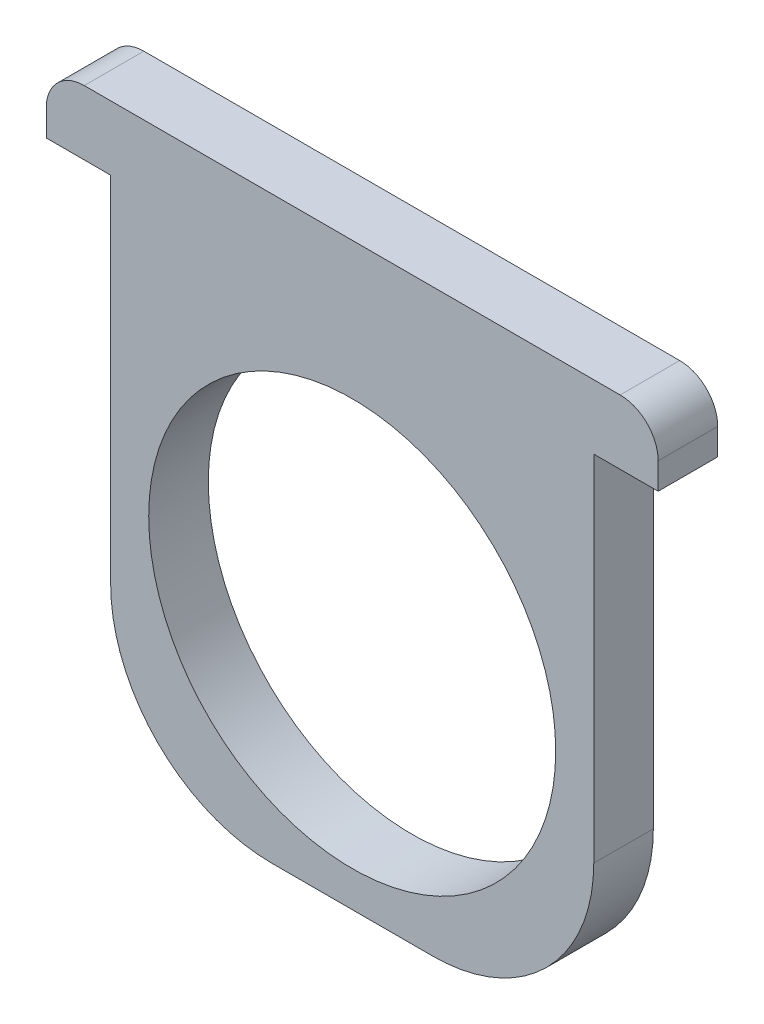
ISO-10303-21;
HEADER;
FILE_DESCRIPTION(('STEP AP214'),'2;1');
FILE_NAME('part.step','',(''),(''),'','','');
FILE_SCHEMA(('AUTOMOTIVE_DESIGN { 1 0 10303 214 1 1 1 1 }'));
ENDSEC;
DATA;
#1=APPLICATION_CONTEXT('core data for automotive mechanical design processes');
#2=APPLICATION_PROTOCOL_DEFINITION('international standard','automotive_design',2000,#1);
#3=PRODUCT_CONTEXT('',#1,'mechanical');
#4=PRODUCT('Part','Part','',(#3));
#5=PRODUCT_RELATED_PRODUCT_CATEGORY('part','',(#4));
#6=PRODUCT_DEFINITION_FORMATION('','',#4);
#7=PRODUCT_DEFINITION_CONTEXT('part definition',#1,'design');
#8=PRODUCT_DEFINITION('design','',#6,#7);
#9=PRODUCT_DEFINITION_SHAPE('','',#8);
#10=(LENGTH_UNIT() NAMED_UNIT(*) SI_UNIT(.MILLI.,.METRE.));
#11=(NAMED_UNIT(*) PLANE_ANGLE_UNIT() SI_UNIT($,.RADIAN.));
#12=(NAMED_UNIT(*) SI_UNIT($,.STERADIAN.) SOLID_ANGLE_UNIT());
#13=UNCERTAINTY_MEASURE_WITH_UNIT(LENGTH_MEASURE(1.E-05),#10,'distance_accuracy_value','');
#14=(GEOMETRIC_REPRESENTATION_CONTEXT(3) GLOBAL_UNCERTAINTY_ASSIGNED_CONTEXT((#13)) GLOBAL_UNIT_ASSIGNED_CONTEXT((#10,
#11,#12)) REPRESENTATION_CONTEXT('',''));
#15=CARTESIAN_POINT('',(0.,0.,0.));
#16=DIRECTION('',(0.,0.,1.));
#17=DIRECTION('',(1.,0.,0.));
#18=AXIS2_PLACEMENT_3D('',#15,#16,#17);
#19=CARTESIAN_POINT('',(-24.13,25.4,2.3495));
#20=DIRECTION('',(1.,0.,0.));
#21=DIRECTION('',(0.,0.,-1.));
#22=AXIS2_PLACEMENT_3D('',#19,#20,#21);
#23=PLANE('',#22);
#24=DIRECTION('',(0.,-1.,0.));
#25=VECTOR('',#24,1.);
#26=CARTESIAN_POINT('',(-24.13,25.4,2.3495));
#27=LINE('',#26,#25);
#28=CARTESIAN_POINT('',(-24.13,22.4,2.3495));
#29=VERTEX_POINT('',#28);
#30=CARTESIAN_POINT('',(-24.13,20.32,2.3495));
#31=VERTEX_POINT('',#30);
#32=EDGE_CURVE('E122',#29,#31,#27,.T.);
#33=ORIENTED_EDGE('',*,*,#32,.F.);
#34=DIRECTION('',(0.,0.,-1.));
#35=VECTOR('',#34,1.);
#36=CARTESIAN_POINT('',(-24.13,22.4,2.3495));
#37=LINE('',#36,#35);
#38=CARTESIAN_POINT('',(-24.13,22.4,-2.3495));
#39=VERTEX_POINT('',#38);
#40=EDGE_CURVE('E11',#29,#39,#37,.T.);
#41=ORIENTED_EDGE('',*,*,#40,.T.);
#42=DIRECTION('',(0.,-1.,0.));
#43=VECTOR('',#42,1.);
#44=CARTESIAN_POINT('',(-24.13,25.4,-2.3495));
#45=LINE('',#44,#43);
#46=CARTESIAN_POINT('',(-24.13,20.32,-2.3495));
#47=VERTEX_POINT('',#46);
#48=EDGE_CURVE('E143',#39,#47,#45,.T.);
#49=ORIENTED_EDGE('',*,*,#48,.T.);
#50=DIRECTION('',(0.,0.,-1.));
#51=VECTOR('',#50,1.);
#52=CARTESIAN_POINT('',(-24.13,20.32,2.3495));
#53=LINE('',#52,#51);
#54=EDGE_CURVE('E136',#31,#47,#53,.T.);
#55=ORIENTED_EDGE('',*,*,#54,.F.);
#56=EDGE_LOOP('',(#33,#41,#49,#55));
#57=FACE_BOUND('',#56,.T.);
#58=ADVANCED_FACE('F33',(#57),#23,.F.);
#59=CARTESIAN_POINT('',(-24.13,20.32,2.3495));
#60=DIRECTION('',(0.,1.,0.));
#61=DIRECTION('',(0.,0.,1.));
#62=AXIS2_PLACEMENT_3D('',#59,#60,#61);
#63=PLANE('',#62);
#64=DIRECTION('',(1.,0.,0.));
#65=VECTOR('',#64,1.);
#66=CARTESIAN_POINT('',(-24.13,20.32,-2.3495));
#67=LINE('',#66,#65);
#68=CARTESIAN_POINT('',(-19.05,20.32,-2.3495));
#69=VERTEX_POINT('',#68);
#70=EDGE_CURVE('E224',#47,#69,#67,.T.);
#71=ORIENTED_EDGE('',*,*,#70,.T.);
#72=DIRECTION('',(0.,0.,-1.));
#73=VECTOR('',#72,1.);
#74=CARTESIAN_POINT('',(-19.05,20.32,2.3495));
#75=LINE('',#74,#73);
#76=CARTESIAN_POINT('',(-19.05,20.32,2.3495));
#77=VERTEX_POINT('',#76);
#78=EDGE_CURVE('E138',#77,#69,#75,.T.);
#79=ORIENTED_EDGE('',*,*,#78,.F.);
#80=DIRECTION('',(1.,0.,0.));
#81=VECTOR('',#80,1.);
#82=CARTESIAN_POINT('',(-24.13,20.32,2.3495));
#83=LINE('',#82,#81);
#84=EDGE_CURVE('E126',#31,#77,#83,.T.);
#85=ORIENTED_EDGE('',*,*,#84,.F.);
#86=ORIENTED_EDGE('',*,*,#54,.T.);
#87=EDGE_LOOP('',(#71,#79,#85,#86));
#88=FACE_BOUND('',#87,.T.);
#89=ADVANCED_FACE('F135',(#88),#63,.F.);
#90=CARTESIAN_POINT('',(-19.05,20.32,2.3495));
#91=DIRECTION('',(1.,0.,0.));
#92=DIRECTION('',(0.,0.,-1.));
#93=AXIS2_PLACEMENT_3D('',#90,#91,#92);
#94=PLANE('',#93);
#95=DIRECTION('',(0.,-1.,0.));
#96=VECTOR('',#95,1.);
#97=CARTESIAN_POINT('',(-19.05,20.32,-2.3495));
#98=LINE('',#97,#96);
#99=CARTESIAN_POINT('',(-19.05,-7.62,-2.3495));
#100=VERTEX_POINT('',#99);
#101=EDGE_CURVE('E219',#69,#100,#98,.T.);
#102=ORIENTED_EDGE('',*,*,#101,.T.);
#103=DIRECTION('',(0.,0.,-1.));
#104=VECTOR('',#103,1.);
#105=CARTESIAN_POINT('',(-19.05,-7.62,2.3495));
#106=LINE('',#105,#104);
#107=CARTESIAN_POINT('',(-19.05,-7.62,2.3495));
#108=VERTEX_POINT('',#107);
#109=EDGE_CURVE('E159',#100,#108,#106,.F.);
#110=ORIENTED_EDGE('',*,*,#109,.T.);
#111=DIRECTION('',(0.,-1.,0.));
#112=VECTOR('',#111,1.);
#113=CARTESIAN_POINT('',(-19.05,20.32,2.3495));
#114=LINE('',#113,#112);
#115=EDGE_CURVE('E140',#77,#108,#114,.T.);
#116=ORIENTED_EDGE('',*,*,#115,.F.);
#117=ORIENTED_EDGE('',*,*,#78,.T.);
#118=EDGE_LOOP('',(#102,#110,#116,#117));
#119=FACE_BOUND('',#118,.T.);
#120=ADVANCED_FACE('F262',(#119),#94,.F.);
#121=CARTESIAN_POINT('',(-19.05,-20.32,2.3495));
#122=DIRECTION('',(0.,1.,0.));
#123=DIRECTION('',(0.,0.,1.));
#124=AXIS2_PLACEMENT_3D('',#121,#122,#123);
#125=PLANE('',#124);
#126=DIRECTION('',(1.,0.,0.));
#127=VECTOR('',#126,1.);
#128=CARTESIAN_POINT('',(-19.05,-20.32,2.3495));
#129=LINE('',#128,#127);
#130=CARTESIAN_POINT('',(-6.35,-20.32,2.3495));
#131=VERTEX_POINT('',#130);
#132=CARTESIAN_POINT('',(6.34999999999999,-20.32,2.3495));
#133=VERTEX_POINT('',#132);
#134=EDGE_CURVE('E232',#131,#133,#129,.T.);
#135=ORIENTED_EDGE('',*,*,#134,.F.);
#136=DIRECTION('',(0.,0.,-1.));
#137=VECTOR('',#136,1.);
#138=CARTESIAN_POINT('',(-6.35,-20.32,2.3495));
#139=LINE('',#138,#137);
#140=CARTESIAN_POINT('',(-6.35,-20.32,-2.3495));
#141=VERTEX_POINT('',#140);
#142=EDGE_CURVE('E147',#131,#141,#139,.T.);
#143=ORIENTED_EDGE('',*,*,#142,.T.);
#144=DIRECTION('',(1.,0.,0.));
#145=VECTOR('',#144,1.);
#146=CARTESIAN_POINT('',(-19.05,-20.32,-2.3495));
#147=LINE('',#146,#145);
#148=CARTESIAN_POINT('',(6.34999999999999,-20.32,-2.3495));
#149=VERTEX_POINT('',#148);
#150=EDGE_CURVE('E218',#141,#149,#147,.T.);
#151=ORIENTED_EDGE('',*,*,#150,.T.);
#152=DIRECTION('',(0.,0.,-1.));
#153=VECTOR('',#152,1.);
#154=CARTESIAN_POINT('',(6.35,-20.32,2.3495));
#155=LINE('',#154,#153);
#156=EDGE_CURVE('E145',#149,#133,#155,.F.);
#157=ORIENTED_EDGE('',*,*,#156,.T.);
#158=EDGE_LOOP('',(#135,#143,#151,#157));
#159=FACE_BOUND('',#158,.T.);
#160=ADVANCED_FACE('F286',(#159),#125,.F.);
#161=CARTESIAN_POINT('',(19.05,-20.32,2.3495));
#162=DIRECTION('',(-1.,0.,0.));
#163=DIRECTION('',(0.,0.,1.));
#164=AXIS2_PLACEMENT_3D('',#161,#162,#163);
#165=PLANE('',#164);
#166=DIRECTION('',(0.,1.,0.));
#167=VECTOR('',#166,1.);
#168=CARTESIAN_POINT('',(19.05,-20.32,2.3495));
#169=LINE('',#168,#167);
#170=CARTESIAN_POINT('',(19.05,-7.62,2.3495));
#171=VERTEX_POINT('',#170);
#172=CARTESIAN_POINT('',(19.05,20.32,2.3495));
#173=VERTEX_POINT('',#172);
#174=EDGE_CURVE('E230',#171,#173,#169,.T.);
#175=ORIENTED_EDGE('',*,*,#174,.F.);
#176=DIRECTION('',(0.,0.,-1.));
#177=VECTOR('',#176,1.);
#178=CARTESIAN_POINT('',(19.05,-7.62,2.3495));
#179=LINE('',#178,#177);
#180=CARTESIAN_POINT('',(19.05,-7.62,-2.3495));
#181=VERTEX_POINT('',#180);
#182=EDGE_CURVE('E165',#171,#181,#179,.T.);
#183=ORIENTED_EDGE('',*,*,#182,.T.);
#184=DIRECTION('',(0.,1.,0.));
#185=VECTOR('',#184,1.);
#186=CARTESIAN_POINT('',(19.05,-20.32,-2.3495));
#187=LINE('',#186,#185);
#188=CARTESIAN_POINT('',(19.05,20.32,-2.3495));
#189=VERTEX_POINT('',#188);
#190=EDGE_CURVE('E203',#181,#189,#187,.T.);
#191=ORIENTED_EDGE('',*,*,#190,.T.);
#192=DIRECTION('',(0.,0.,-1.));
#193=VECTOR('',#192,1.);
#194=CARTESIAN_POINT('',(19.05,20.32,2.3495));
#195=LINE('',#194,#193);
#196=EDGE_CURVE('E149',#173,#189,#195,.T.);
#197=ORIENTED_EDGE('',*,*,#196,.F.);
#198=EDGE_LOOP('',(#175,#183,#191,#197));
#199=FACE_BOUND('',#198,.T.);
#200=ADVANCED_FACE('F290',(#199),#165,.F.);
#201=CARTESIAN_POINT('',(19.05,20.32,2.3495));
#202=DIRECTION('',(0.,1.,0.));
#203=DIRECTION('',(0.,0.,1.));
#204=AXIS2_PLACEMENT_3D('',#201,#202,#203);
#205=PLANE('',#204);
#206=DIRECTION('',(1.,0.,0.));
#207=VECTOR('',#206,1.);
#208=CARTESIAN_POINT('',(19.05,20.32,-2.3495));
#209=LINE('',#208,#207);
#210=CARTESIAN_POINT('',(24.13,20.32,-2.3495));
#211=VERTEX_POINT('',#210);
#212=EDGE_CURVE('E200',#189,#211,#209,.T.);
#213=ORIENTED_EDGE('',*,*,#212,.T.);
#214=DIRECTION('',(0.,0.,-1.));
#215=VECTOR('',#214,1.);
#216=CARTESIAN_POINT('',(24.13,20.32,2.3495));
#217=LINE('',#216,#215);
#218=CARTESIAN_POINT('',(24.13,20.32,2.3495));
#219=VERTEX_POINT('',#218);
#220=EDGE_CURVE('E189',#219,#211,#217,.T.);
#221=ORIENTED_EDGE('',*,*,#220,.F.);
#222=DIRECTION('',(1.,0.,0.));
#223=VECTOR('',#222,1.);
#224=CARTESIAN_POINT('',(19.05,20.32,2.3495));
#225=LINE('',#224,#223);
#226=EDGE_CURVE('E212',#173,#219,#225,.T.);
#227=ORIENTED_EDGE('',*,*,#226,.F.);
#228=ORIENTED_EDGE('',*,*,#196,.T.);
#229=EDGE_LOOP('',(#213,#221,#227,#228));
#230=FACE_BOUND('',#229,.T.);
#231=ADVANCED_FACE('F211',(#230),#205,.F.);
#232=CARTESIAN_POINT('',(24.13,20.32,2.3495));
#233=DIRECTION('',(-1.,0.,0.));
#234=DIRECTION('',(0.,0.,1.));
#235=AXIS2_PLACEMENT_3D('',#232,#233,#234);
#236=PLANE('',#235);
#237=DIRECTION('',(0.,1.,0.));
#238=VECTOR('',#237,1.);
#239=CARTESIAN_POINT('',(24.13,20.32,-2.3495));
#240=LINE('',#239,#238);
#241=CARTESIAN_POINT('',(24.13,22.4,-2.3495));
#242=VERTEX_POINT('',#241);
#243=EDGE_CURVE('E196',#211,#242,#240,.T.);
#244=ORIENTED_EDGE('',*,*,#243,.T.);
#245=DIRECTION('',(0.,0.,-1.));
#246=VECTOR('',#245,1.);
#247=CARTESIAN_POINT('',(24.13,22.4,2.3495));
#248=LINE('',#247,#246);
#249=CARTESIAN_POINT('',(24.13,22.4,2.3495));
#250=VERTEX_POINT('',#249);
#251=EDGE_CURVE('E56',#242,#250,#248,.F.);
#252=ORIENTED_EDGE('',*,*,#251,.T.);
#253=DIRECTION('',(0.,1.,0.));
#254=VECTOR('',#253,1.);
#255=CARTESIAN_POINT('',(24.13,20.32,2.3495));
#256=LINE('',#255,#254);
#257=EDGE_CURVE('E181',#219,#250,#256,.T.);
#258=ORIENTED_EDGE('',*,*,#257,.F.);
#259=ORIENTED_EDGE('',*,*,#220,.T.);
#260=EDGE_LOOP('',(#244,#252,#258,#259));
#261=FACE_BOUND('',#260,.T.);
#262=ADVANCED_FACE('F198',(#261),#236,.F.);
#263=CARTESIAN_POINT('',(24.13,25.4,2.3495));
#264=DIRECTION('',(0.,-1.,0.));
#265=DIRECTION('',(0.,0.,-1.));
#266=AXIS2_PLACEMENT_3D('',#263,#264,#265);
#267=PLANE('',#266);
#268=DIRECTION('',(-1.,0.,0.));
#269=VECTOR('',#268,1.);
#270=CARTESIAN_POINT('',(24.13,25.4,2.3495));
#271=LINE('',#270,#269);
#272=CARTESIAN_POINT('',(21.13,25.4,2.3495));
#273=VERTEX_POINT('',#272);
#274=CARTESIAN_POINT('',(-21.13,25.4,2.3495));
#275=VERTEX_POINT('',#274);
#276=EDGE_CURVE('E180',#273,#275,#271,.T.);
#277=ORIENTED_EDGE('',*,*,#276,.F.);
#278=DIRECTION('',(0.,0.,-1.));
#279=VECTOR('',#278,1.);
#280=CARTESIAN_POINT('',(21.13,25.4,2.3495));
#281=LINE('',#280,#279);
#282=CARTESIAN_POINT('',(21.13,25.4,-2.3495));
#283=VERTEX_POINT('',#282);
#284=EDGE_CURVE('E170',#273,#283,#281,.T.);
#285=ORIENTED_EDGE('',*,*,#284,.T.);
#286=DIRECTION('',(-1.,0.,0.));
#287=VECTOR('',#286,1.);
#288=CARTESIAN_POINT('',(24.13,25.4,-2.3495));
#289=LINE('',#288,#287);
#290=CARTESIAN_POINT('',(-21.13,25.4,-2.3495));
#291=VERTEX_POINT('',#290);
#292=EDGE_CURVE('E131',#283,#291,#289,.T.);
#293=ORIENTED_EDGE('',*,*,#292,.T.);
#294=DIRECTION('',(0.,0.,-1.));
#295=VECTOR('',#294,1.);
#296=CARTESIAN_POINT('',(-21.13,25.4,2.3495));
#297=LINE('',#296,#295);
#298=EDGE_CURVE('E168',#291,#275,#297,.F.);
#299=ORIENTED_EDGE('',*,*,#298,.T.);
#300=EDGE_LOOP('',(#277,#285,#293,#299));
#301=FACE_BOUND('',#300,.T.);
#302=ADVANCED_FACE('F185',(#301),#267,.F.);
#303=CARTESIAN_POINT('',(0.,0.,2.3495));
#304=DIRECTION('',(0.,0.,1.));
#305=DIRECTION('',(1.,0.,0.));
#306=AXIS2_PLACEMENT_3D('',#303,#304,#305);
#307=PLANE('',#306);
#308=CARTESIAN_POINT('',(0.,-1.46800000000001,2.3495));
#309=DIRECTION('',(0.,0.,-1.));
#310=DIRECTION('',(-1.,0.,0.));
#311=AXIS2_PLACEMENT_3D('',#308,#309,#310);
#312=CIRCLE('',#311,16.05);
#313=CARTESIAN_POINT('',(-16.05,-1.46800000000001,2.3495));
#314=VERTEX_POINT('',#313);
#315=EDGE_CURVE('E226',#314,#314,#312,.T.);
#316=ORIENTED_EDGE('',*,*,#315,.T.);
#317=EDGE_LOOP('',(#316));
#318=FACE_BOUND('',#317,.T.);
#319=ORIENTED_EDGE('',*,*,#257,.T.);
#320=CARTESIAN_POINT('',(21.13,22.4,2.3495));
#321=DIRECTION('',(0.,0.,1.));
#322=DIRECTION('',(1.,0.,0.));
#323=AXIS2_PLACEMENT_3D('',#320,#321,#322);
#324=CIRCLE('',#323,3.);
#325=EDGE_CURVE('E41',#250,#273,#324,.T.);
#326=ORIENTED_EDGE('',*,*,#325,.T.);
#327=ORIENTED_EDGE('',*,*,#276,.T.);
#328=CARTESIAN_POINT('',(-21.13,22.4,2.3495));
#329=DIRECTION('',(0.,0.,1.));
#330=DIRECTION('',(1.,0.,0.));
#331=AXIS2_PLACEMENT_3D('',#328,#329,#330);
#332=CIRCLE('',#331,3.);
#333=EDGE_CURVE('E48',#275,#29,#332,.T.);
#334=ORIENTED_EDGE('',*,*,#333,.T.);
#335=ORIENTED_EDGE('',*,*,#32,.T.);
#336=ORIENTED_EDGE('',*,*,#84,.T.);
#337=ORIENTED_EDGE('',*,*,#115,.T.);
#338=CARTESIAN_POINT('',(-6.35,-7.62,2.3495));
#339=DIRECTION('',(0.,0.,1.));
#340=DIRECTION('',(1.,0.,0.));
#341=AXIS2_PLACEMENT_3D('',#338,#339,#340);
#342=CIRCLE('',#341,12.7);
#343=EDGE_CURVE('E163',#108,#131,#342,.T.);
#344=ORIENTED_EDGE('',*,*,#343,.T.);
#345=ORIENTED_EDGE('',*,*,#134,.T.);
#346=CARTESIAN_POINT('',(6.35,-7.62,2.3495));
#347=DIRECTION('',(0.,0.,1.));
#348=DIRECTION('',(1.,0.,0.));
#349=AXIS2_PLACEMENT_3D('',#346,#347,#348);
#350=CIRCLE('',#349,12.7);
#351=EDGE_CURVE('E161',#133,#171,#350,.T.);
#352=ORIENTED_EDGE('',*,*,#351,.T.);
#353=ORIENTED_EDGE('',*,*,#174,.T.);
#354=ORIENTED_EDGE('',*,*,#226,.T.);
#355=EDGE_LOOP('',(#319,#326,#327,#334,#335,#336,#337,#344,#345,#352,#353,#354));
#356=FACE_BOUND('',#355,.T.);
#357=ADVANCED_FACE('F124',(#318,#356),#307,.T.);
#358=CARTESIAN_POINT('',(0.,0.,-2.3495));
#359=DIRECTION('',(0.,0.,1.));
#360=DIRECTION('',(1.,0.,0.));
#361=AXIS2_PLACEMENT_3D('',#358,#359,#360);
#362=PLANE('',#361);
#363=CARTESIAN_POINT('',(0.,-1.46800000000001,-2.3495));
#364=DIRECTION('',(0.,0.,-1.));
#365=DIRECTION('',(-1.,0.,0.));
#366=AXIS2_PLACEMENT_3D('',#363,#364,#365);
#367=CIRCLE('',#366,16.05);
#368=CARTESIAN_POINT('',(-16.05,-1.46800000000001,-2.3495));
#369=VERTEX_POINT('',#368);
#370=EDGE_CURVE('E236',#369,#369,#367,.T.);
#371=ORIENTED_EDGE('',*,*,#370,.F.);
#372=EDGE_LOOP('',(#371));
#373=FACE_BOUND('',#372,.T.);
#374=ORIENTED_EDGE('',*,*,#292,.F.);
#375=CARTESIAN_POINT('',(21.13,22.4,-2.3495));
#376=DIRECTION('',(0.,0.,1.));
#377=DIRECTION('',(1.,0.,0.));
#378=AXIS2_PLACEMENT_3D('',#375,#376,#377);
#379=CIRCLE('',#378,3.);
#380=EDGE_CURVE('E175',#283,#242,#379,.F.);
#381=ORIENTED_EDGE('',*,*,#380,.T.);
#382=ORIENTED_EDGE('',*,*,#243,.F.);
#383=ORIENTED_EDGE('',*,*,#212,.F.);
#384=ORIENTED_EDGE('',*,*,#190,.F.);
#385=CARTESIAN_POINT('',(6.35,-7.62,-2.3495));
#386=DIRECTION('',(0.,0.,1.));
#387=DIRECTION('',(1.,0.,0.));
#388=AXIS2_PLACEMENT_3D('',#385,#386,#387);
#389=CIRCLE('',#388,12.7);
#390=EDGE_CURVE('E155',#181,#149,#389,.F.);
#391=ORIENTED_EDGE('',*,*,#390,.T.);
#392=ORIENTED_EDGE('',*,*,#150,.F.);
#393=CARTESIAN_POINT('',(-6.35,-7.62,-2.3495));
#394=DIRECTION('',(0.,0.,1.));
#395=DIRECTION('',(1.,0.,0.));
#396=AXIS2_PLACEMENT_3D('',#393,#394,#395);
#397=CIRCLE('',#396,12.7);
#398=EDGE_CURVE('E157',#141,#100,#397,.F.);
#399=ORIENTED_EDGE('',*,*,#398,.T.);
#400=ORIENTED_EDGE('',*,*,#101,.F.);
#401=ORIENTED_EDGE('',*,*,#70,.F.);
#402=ORIENTED_EDGE('',*,*,#48,.F.);
#403=CARTESIAN_POINT('',(-21.13,22.4,-2.3495));
#404=DIRECTION('',(0.,0.,1.));
#405=DIRECTION('',(1.,0.,0.));
#406=AXIS2_PLACEMENT_3D('',#403,#404,#405);
#407=CIRCLE('',#406,3.);
#408=EDGE_CURVE('E173',#39,#291,#407,.F.);
#409=ORIENTED_EDGE('',*,*,#408,.T.);
#410=EDGE_LOOP('',(#374,#381,#382,#383,#384,#391,#392,#399,#400,#401,#402,#409));
#411=FACE_BOUND('',#410,.T.);
#412=ADVANCED_FACE('F194',(#373,#411),#362,.F.);
#413=CARTESIAN_POINT('',(0.,-1.46800000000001,2.3495));
#414=DIRECTION('',(0.,0.,-1.));
#415=DIRECTION('',(-1.,0.,0.));
#416=AXIS2_PLACEMENT_3D('',#413,#414,#415);
#417=CYLINDRICAL_SURFACE('',#416,16.05);
#418=ORIENTED_EDGE('',*,*,#315,.F.);
#419=EDGE_LOOP('',(#418));
#420=FACE_BOUND('',#419,.T.);
#421=ORIENTED_EDGE('',*,*,#370,.T.);
#422=EDGE_LOOP('',(#421));
#423=FACE_BOUND('',#422,.T.);
#424=ADVANCED_FACE('F243',(#420,#423),#417,.F.);
#425=CARTESIAN_POINT('',(-6.35,-7.62,2.3495));
#426=DIRECTION('',(0.,0.,-1.));
#427=DIRECTION('',(-1.,0.,0.));
#428=AXIS2_PLACEMENT_3D('',#425,#426,#427);
#429=CYLINDRICAL_SURFACE('',#428,12.7);
#430=ORIENTED_EDGE('',*,*,#343,.F.);
#431=ORIENTED_EDGE('',*,*,#109,.F.);
#432=ORIENTED_EDGE('',*,*,#398,.F.);
#433=ORIENTED_EDGE('',*,*,#142,.F.);
#434=EDGE_LOOP('',(#430,#431,#432,#433));
#435=FACE_BOUND('',#434,.T.);
#436=ADVANCED_FACE('F246',(#435),#429,.T.);
#437=CARTESIAN_POINT('',(6.35,-7.62,2.3495));
#438=DIRECTION('',(0.,0.,-1.));
#439=DIRECTION('',(-1.,0.,0.));
#440=AXIS2_PLACEMENT_3D('',#437,#438,#439);
#441=CYLINDRICAL_SURFACE('',#440,12.7);
#442=ORIENTED_EDGE('',*,*,#351,.F.);
#443=ORIENTED_EDGE('',*,*,#156,.F.);
#444=ORIENTED_EDGE('',*,*,#390,.F.);
#445=ORIENTED_EDGE('',*,*,#182,.F.);
#446=EDGE_LOOP('',(#442,#443,#444,#445));
#447=FACE_BOUND('',#446,.T.);
#448=ADVANCED_FACE('F268',(#447),#441,.T.);
#449=CARTESIAN_POINT('',(21.13,22.4,2.3495));
#450=DIRECTION('',(0.,0.,-1.));
#451=DIRECTION('',(-1.,0.,0.));
#452=AXIS2_PLACEMENT_3D('',#449,#450,#451);
#453=CYLINDRICAL_SURFACE('',#452,3.);
#454=ORIENTED_EDGE('',*,*,#325,.F.);
#455=ORIENTED_EDGE('',*,*,#251,.F.);
#456=ORIENTED_EDGE('',*,*,#380,.F.);
#457=ORIENTED_EDGE('',*,*,#284,.F.);
#458=EDGE_LOOP('',(#454,#455,#456,#457));
#459=FACE_BOUND('',#458,.T.);
#460=ADVANCED_FACE('F191',(#459),#453,.T.);
#461=CARTESIAN_POINT('',(-21.13,22.4,2.3495));
#462=DIRECTION('',(0.,0.,-1.));
#463=DIRECTION('',(-1.,0.,0.));
#464=AXIS2_PLACEMENT_3D('',#461,#462,#463);
#465=CYLINDRICAL_SURFACE('',#464,3.);
#466=ORIENTED_EDGE('',*,*,#333,.F.);
#467=ORIENTED_EDGE('',*,*,#298,.F.);
#468=ORIENTED_EDGE('',*,*,#408,.F.);
#469=ORIENTED_EDGE('',*,*,#40,.F.);
#470=EDGE_LOOP('',(#466,#467,#468,#469));
#471=FACE_BOUND('',#470,.T.);
#472=ADVANCED_FACE('F35',(#471),#465,.T.);
#473=CLOSED_SHELL('',(#58,#89,#120,#160,#200,#231,#262,#302,#357,#412,#424,#436,#448,#460,#472));
#474=MANIFOLD_SOLID_BREP('B2',#473);
#475=ADVANCED_BREP_SHAPE_REPRESENTATION('',(#18,#474),#14);
#476=SHAPE_DEFINITION_REPRESENTATION(#9,#475);
ENDSEC;
END-ISO-10303-21;
